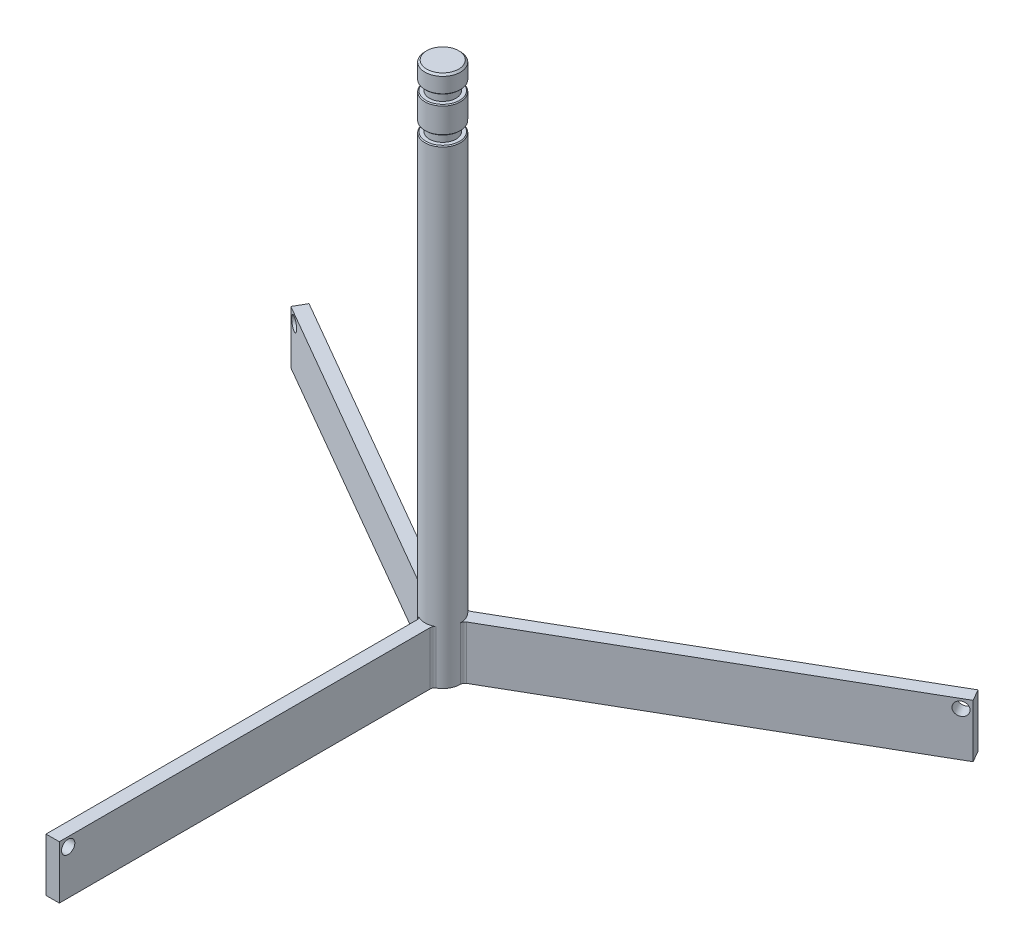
ISO-10303-21;
HEADER;
FILE_DESCRIPTION(('STEP AP214'),'2;1');
FILE_NAME('part.step','',(''),(''),'','','');
FILE_SCHEMA(('AUTOMOTIVE_DESIGN { 1 0 10303 214 1 1 1 1 }'));
ENDSEC;
DATA;
#1=APPLICATION_CONTEXT('core data for automotive mechanical design processes');
#2=APPLICATION_PROTOCOL_DEFINITION('international standard','automotive_design',2000,#1);
#3=PRODUCT_CONTEXT('',#1,'mechanical');
#4=PRODUCT('Part','Part','',(#3));
#5=PRODUCT_RELATED_PRODUCT_CATEGORY('part','',(#4));
#6=PRODUCT_DEFINITION_FORMATION('','',#4);
#7=PRODUCT_DEFINITION_CONTEXT('part definition',#1,'design');
#8=PRODUCT_DEFINITION('design','',#6,#7);
#9=PRODUCT_DEFINITION_SHAPE('','',#8);
#10=(LENGTH_UNIT() NAMED_UNIT(*) SI_UNIT(.MILLI.,.METRE.));
#11=(NAMED_UNIT(*) PLANE_ANGLE_UNIT() SI_UNIT($,.RADIAN.));
#12=(NAMED_UNIT(*) SI_UNIT($,.STERADIAN.) SOLID_ANGLE_UNIT());
#13=UNCERTAINTY_MEASURE_WITH_UNIT(LENGTH_MEASURE(1.E-05),#10,'distance_accuracy_value','');
#14=(GEOMETRIC_REPRESENTATION_CONTEXT(3) GLOBAL_UNCERTAINTY_ASSIGNED_CONTEXT((#13)) GLOBAL_UNIT_ASSIGNED_CONTEXT((#10,
#11,#12)) REPRESENTATION_CONTEXT('',''));
#15=CARTESIAN_POINT('',(0.,0.,0.));
#16=DIRECTION('',(0.,0.,1.));
#17=DIRECTION('',(1.,0.,0.));
#18=AXIS2_PLACEMENT_3D('',#15,#16,#17);
#19=CARTESIAN_POINT('',(0.,381.,0.));
#20=DIRECTION('',(0.,-1.,0.));
#21=DIRECTION('',(0.,0.,-1.));
#22=AXIS2_PLACEMENT_3D('',#19,#20,#21);
#23=CYLINDRICAL_SURFACE('',#22,12.7);
#24=CARTESIAN_POINT('',(0.,361.315,0.));
#25=DIRECTION('',(0.,-1.,0.));
#26=DIRECTION('',(0.,0.,-1.));
#27=AXIS2_PLACEMENT_3D('',#24,#25,#26);
#28=CIRCLE('',#27,12.7);
#29=CARTESIAN_POINT('',(0.,361.315,-12.7));
#30=VERTEX_POINT('',#29);
#31=EDGE_CURVE('E334',#30,#30,#28,.T.);
#32=ORIENTED_EDGE('',*,*,#31,.T.);
#33=EDGE_LOOP('',(#32));
#34=FACE_BOUND('',#33,.T.);
#35=CARTESIAN_POINT('',(0.,343.535,0.));
#36=DIRECTION('',(0.,1.,0.));
#37=DIRECTION('',(0.,0.,1.));
#38=AXIS2_PLACEMENT_3D('',#35,#36,#37);
#39=CIRCLE('',#38,12.7);
#40=CARTESIAN_POINT('',(0.,343.535,12.7));
#41=VERTEX_POINT('',#40);
#42=EDGE_CURVE('E316',#41,#41,#39,.T.);
#43=ORIENTED_EDGE('',*,*,#42,.T.);
#44=EDGE_LOOP('',(#43));
#45=FACE_BOUND('',#44,.T.);
#46=ADVANCED_FACE('F32',(#34,#45),#23,.T.);
#47=CARTESIAN_POINT('',(0.,335.915,0.));
#48=DIRECTION('',(0.,-1.,0.));
#49=DIRECTION('',(0.,0.,-1.));
#50=AXIS2_PLACEMENT_3D('',#47,#48,#49);
#51=CIRCLE('',#50,12.7);
#52=CARTESIAN_POINT('',(0.,335.915,-12.7));
#53=VERTEX_POINT('',#52);
#54=EDGE_CURVE('E322',#53,#53,#51,.T.);
#55=ORIENTED_EDGE('',*,*,#54,.T.);
#56=EDGE_LOOP('',(#55));
#57=FACE_BOUND('',#56,.T.);
#58=CARTESIAN_POINT('',(0.,0.,0.));
#59=DIRECTION('',(0.,1.,0.));
#60=DIRECTION('',(0.,0.,1.));
#61=AXIS2_PLACEMENT_3D('',#58,#59,#60);
#62=CIRCLE('',#61,12.7);
#63=CARTESIAN_POINT('',(6.35,0.,10.9985226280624));
#64=VERTEX_POINT('',#63);
#65=CARTESIAN_POINT('',(12.7,0.,1.94289029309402E-13));
#66=VERTEX_POINT('',#65);
#67=EDGE_CURVE('E251',#64,#66,#62,.T.);
#68=ORIENTED_EDGE('',*,*,#67,.T.);
#69=DIRECTION('',(0.,-1.,0.));
#70=VECTOR('',#69,1.);
#71=CARTESIAN_POINT('',(12.7,381.,1.94289029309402E-13));
#72=LINE('',#71,#70);
#73=CARTESIAN_POINT('',(12.7,38.1,1.94289029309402E-13));
#74=VERTEX_POINT('',#73);
#75=EDGE_CURVE('E304',#66,#74,#72,.F.);
#76=ORIENTED_EDGE('',*,*,#75,.T.);
#77=CARTESIAN_POINT('',(0.,38.1,0.));
#78=DIRECTION('',(0.,1.,0.));
#79=DIRECTION('',(0.,0.,1.));
#80=AXIS2_PLACEMENT_3D('',#77,#78,#79);
#81=CIRCLE('',#80,12.7);
#82=CARTESIAN_POINT('',(6.3500000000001,38.1,-10.9985226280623));
#83=VERTEX_POINT('',#82);
#84=EDGE_CURVE('E279',#74,#83,#81,.T.);
#85=ORIENTED_EDGE('',*,*,#84,.T.);
#86=DIRECTION('',(0.,-1.,0.));
#87=VECTOR('',#86,1.);
#88=CARTESIAN_POINT('',(6.3500000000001,381.,-10.9985226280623));
#89=LINE('',#88,#87);
#90=CARTESIAN_POINT('',(6.3500000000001,0.,-10.9985226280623));
#91=VERTEX_POINT('',#90);
#92=EDGE_CURVE('E302',#83,#91,#89,.T.);
#93=ORIENTED_EDGE('',*,*,#92,.T.);
#94=CARTESIAN_POINT('',(-6.34999999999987,0.,-10.9985226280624));
#95=VERTEX_POINT('',#94);
#96=EDGE_CURVE('E255',#91,#95,#62,.T.);
#97=ORIENTED_EDGE('',*,*,#96,.T.);
#98=DIRECTION('',(0.,-1.,0.));
#99=VECTOR('',#98,1.);
#100=CARTESIAN_POINT('',(-6.34999999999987,381.,-10.9985226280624));
#101=LINE('',#100,#99);
#102=CARTESIAN_POINT('',(-6.34999999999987,38.1,-10.9985226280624));
#103=VERTEX_POINT('',#102);
#104=EDGE_CURVE('E284',#95,#103,#101,.F.);
#105=ORIENTED_EDGE('',*,*,#104,.T.);
#106=CARTESIAN_POINT('',(-12.7,38.1,0.));
#107=VERTEX_POINT('',#106);
#108=EDGE_CURVE('E280',#103,#107,#81,.T.);
#109=ORIENTED_EDGE('',*,*,#108,.T.);
#110=DIRECTION('',(0.,-1.,0.));
#111=VECTOR('',#110,1.);
#112=CARTESIAN_POINT('',(-12.7,381.,0.));
#113=LINE('',#112,#111);
#114=CARTESIAN_POINT('',(-12.7,0.,0.));
#115=VERTEX_POINT('',#114);
#116=EDGE_CURVE('E282',#107,#115,#113,.T.);
#117=ORIENTED_EDGE('',*,*,#116,.T.);
#118=CARTESIAN_POINT('',(-6.35000000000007,0.,10.9985226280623));
#119=VERTEX_POINT('',#118);
#120=EDGE_CURVE('E242',#115,#119,#62,.T.);
#121=ORIENTED_EDGE('',*,*,#120,.T.);
#122=DIRECTION('',(0.,-1.,0.));
#123=VECTOR('',#122,1.);
#124=CARTESIAN_POINT('',(-6.35000000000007,381.,10.9985226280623));
#125=LINE('',#124,#123);
#126=CARTESIAN_POINT('',(-6.35000000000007,38.1,10.9985226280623));
#127=VERTEX_POINT('',#126);
#128=EDGE_CURVE('E261',#119,#127,#125,.F.);
#129=ORIENTED_EDGE('',*,*,#128,.T.);
#130=CARTESIAN_POINT('',(0.,38.1,0.));
#131=DIRECTION('',(0.,1.,0.));
#132=DIRECTION('',(0.,0.,1.));
#133=AXIS2_PLACEMENT_3D('',#130,#131,#132);
#134=CIRCLE('',#133,12.7);
#135=CARTESIAN_POINT('',(6.35,38.1,10.9985226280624));
#136=VERTEX_POINT('',#135);
#137=EDGE_CURVE('E254',#127,#136,#134,.T.);
#138=ORIENTED_EDGE('',*,*,#137,.T.);
#139=DIRECTION('',(0.,-1.,0.));
#140=VECTOR('',#139,1.);
#141=CARTESIAN_POINT('',(6.35,381.,10.9985226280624));
#142=LINE('',#141,#140);
#143=EDGE_CURVE('E257',#136,#64,#142,.T.);
#144=ORIENTED_EDGE('',*,*,#143,.T.);
#145=EDGE_LOOP('',(#68,#76,#85,#93,#97,#105,#109,#117,#121,#129,#138,#144));
#146=FACE_BOUND('',#145,.T.);
#147=ADVANCED_FACE('F354',(#57,#146),#23,.T.);
#148=CARTESIAN_POINT('',(0.,0.,0.));
#149=DIRECTION('',(0.,1.,0.));
#150=DIRECTION('',(0.,0.,1.));
#151=AXIS2_PLACEMENT_3D('',#148,#149,#150);
#152=PLANE('',#151);
#153=ORIENTED_EDGE('',*,*,#120,.F.);
#154=CARTESIAN_POINT('',(-15.875,0.,0.));
#155=DIRECTION('',(0.,1.,0.));
#156=DIRECTION('',(0.,0.,1.));
#157=AXIS2_PLACEMENT_3D('',#154,#155,#156);
#158=CIRCLE('',#157,3.175);
#159=CARTESIAN_POINT('',(-14.2875,0.,-2.74963065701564));
#160=VERTEX_POINT('',#159);
#161=EDGE_CURVE('E300',#115,#160,#158,.T.);
#162=ORIENTED_EDGE('',*,*,#161,.T.);
#163=DIRECTION('',(0.866025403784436,0.,0.500000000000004));
#164=VECTOR('',#163,1.);
#165=CARTESIAN_POINT('',(-244.348747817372,0.,-135.575554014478));
#166=LINE('',#165,#164);
#167=CARTESIAN_POINT('',(-244.348747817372,0.,-135.575554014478));
#168=VERTEX_POINT('',#167);
#169=EDGE_CURVE('E216',#168,#160,#166,.T.);
#170=ORIENTED_EDGE('',*,*,#169,.F.);
#171=DIRECTION('',(0.500000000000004,0.,-0.866025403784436));
#172=VECTOR('',#171,1.);
#173=CARTESIAN_POINT('',(-244.348747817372,0.,-135.575554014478));
#174=LINE('',#173,#172);
#175=CARTESIAN_POINT('',(-239.586247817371,0.,-143.824445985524));
#176=VERTEX_POINT('',#175);
#177=EDGE_CURVE('E208',#168,#176,#174,.T.);
#178=ORIENTED_EDGE('',*,*,#177,.T.);
#179=DIRECTION('',(0.866025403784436,0.,0.500000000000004));
#180=VECTOR('',#179,1.);
#181=CARTESIAN_POINT('',(-239.586247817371,0.,-143.824445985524));
#182=LINE('',#181,#180);
#183=CARTESIAN_POINT('',(-9.52499999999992,0.,-10.9985226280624));
#184=VERTEX_POINT('',#183);
#185=EDGE_CURVE('E212',#176,#184,#182,.T.);
#186=ORIENTED_EDGE('',*,*,#185,.T.);
#187=CARTESIAN_POINT('',(-7.93749999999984,0.,-13.7481532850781));
#188=DIRECTION('',(0.,1.,0.));
#189=DIRECTION('',(0.,0.,1.));
#190=AXIS2_PLACEMENT_3D('',#187,#188,#189);
#191=CIRCLE('',#190,3.175);
#192=EDGE_CURVE('E294',#184,#95,#191,.T.);
#193=ORIENTED_EDGE('',*,*,#192,.T.);
#194=ORIENTED_EDGE('',*,*,#96,.F.);
#195=CARTESIAN_POINT('',(7.93750000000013,0.,-13.7481532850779));
#196=DIRECTION('',(0.,1.,0.));
#197=DIRECTION('',(0.,0.,1.));
#198=AXIS2_PLACEMENT_3D('',#195,#196,#197);
#199=CIRCLE('',#198,3.175);
#200=CARTESIAN_POINT('',(9.52500000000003,0.,-10.9985226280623));
#201=VERTEX_POINT('',#200);
#202=EDGE_CURVE('E55',#91,#201,#199,.T.);
#203=ORIENTED_EDGE('',*,*,#202,.T.);
#204=DIRECTION('',(-0.866025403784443,0.,0.499999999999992));
#205=VECTOR('',#204,1.);
#206=CARTESIAN_POINT('',(239.586247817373,0.,-143.824445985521));
#207=LINE('',#206,#205);
#208=CARTESIAN_POINT('',(239.586247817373,0.,-143.824445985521));
#209=VERTEX_POINT('',#208);
#210=EDGE_CURVE('E198',#209,#201,#207,.T.);
#211=ORIENTED_EDGE('',*,*,#210,.F.);
#212=DIRECTION('',(0.499999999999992,0.,0.866025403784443));
#213=VECTOR('',#212,1.);
#214=CARTESIAN_POINT('',(239.586247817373,0.,-143.824445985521));
#215=LINE('',#214,#213);
#216=CARTESIAN_POINT('',(244.348747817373,0.,-135.575554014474));
#217=VERTEX_POINT('',#216);
#218=EDGE_CURVE('E171',#209,#217,#215,.T.);
#219=ORIENTED_EDGE('',*,*,#218,.T.);
#220=DIRECTION('',(-0.866025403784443,0.,0.499999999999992));
#221=VECTOR('',#220,1.);
#222=CARTESIAN_POINT('',(244.348747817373,0.,-135.575554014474));
#223=LINE('',#222,#221);
#224=CARTESIAN_POINT('',(14.2874999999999,0.,-2.74963065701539));
#225=VERTEX_POINT('',#224);
#226=EDGE_CURVE('E185',#217,#225,#223,.T.);
#227=ORIENTED_EDGE('',*,*,#226,.T.);
#228=CARTESIAN_POINT('',(15.875,0.,2.42861286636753E-13));
#229=DIRECTION('',(0.,1.,0.));
#230=DIRECTION('',(0.,0.,1.));
#231=AXIS2_PLACEMENT_3D('',#228,#229,#230);
#232=CIRCLE('',#231,3.175);
#233=EDGE_CURVE('E312',#225,#66,#232,.T.);
#234=ORIENTED_EDGE('',*,*,#233,.T.);
#235=ORIENTED_EDGE('',*,*,#67,.F.);
#236=CARTESIAN_POINT('',(7.9375,0.,13.748153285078));
#237=DIRECTION('',(0.,1.,0.));
#238=DIRECTION('',(0.,0.,1.));
#239=AXIS2_PLACEMENT_3D('',#236,#237,#238);
#240=CIRCLE('',#239,3.175);
#241=CARTESIAN_POINT('',(4.7625,0.,13.7481532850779));
#242=VERTEX_POINT('',#241);
#243=EDGE_CURVE('E277',#64,#242,#240,.T.);
#244=ORIENTED_EDGE('',*,*,#243,.T.);
#245=DIRECTION('',(0.,0.,-1.));
#246=VECTOR('',#245,1.);
#247=CARTESIAN_POINT('',(4.7625,0.,279.4));
#248=LINE('',#247,#246);
#249=CARTESIAN_POINT('',(4.7625,0.,279.4));
#250=VERTEX_POINT('',#249);
#251=EDGE_CURVE('E243',#250,#242,#248,.T.);
#252=ORIENTED_EDGE('',*,*,#251,.F.);
#253=DIRECTION('',(-1.,0.,0.));
#254=VECTOR('',#253,1.);
#255=CARTESIAN_POINT('',(4.7625,0.,279.4));
#256=LINE('',#255,#254);
#257=CARTESIAN_POINT('',(-4.7625,0.,279.4));
#258=VERTEX_POINT('',#257);
#259=EDGE_CURVE('E235',#250,#258,#256,.T.);
#260=ORIENTED_EDGE('',*,*,#259,.T.);
#261=DIRECTION('',(0.,0.,-1.));
#262=VECTOR('',#261,1.);
#263=CARTESIAN_POINT('',(-4.7625,0.,279.4));
#264=LINE('',#263,#262);
#265=CARTESIAN_POINT('',(-4.7625,0.,13.7481532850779));
#266=VERTEX_POINT('',#265);
#267=EDGE_CURVE('E239',#258,#266,#264,.T.);
#268=ORIENTED_EDGE('',*,*,#267,.T.);
#269=CARTESIAN_POINT('',(-7.93750000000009,0.,13.7481532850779));
#270=DIRECTION('',(0.,1.,0.));
#271=DIRECTION('',(0.,0.,1.));
#272=AXIS2_PLACEMENT_3D('',#269,#270,#271);
#273=CIRCLE('',#272,3.175);
#274=EDGE_CURVE('E271',#266,#119,#273,.T.);
#275=ORIENTED_EDGE('',*,*,#274,.T.);
#276=EDGE_LOOP('',(#153,#162,#170,#178,#186,#193,#194,#203,#211,#219,#227,#234,#235,#244,#252,
#260,#268,#275));
#277=FACE_BOUND('',#276,.T.);
#278=ADVANCED_FACE('F361',(#277),#152,.F.);
#279=CARTESIAN_POINT('',(-4.76250000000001,38.1,279.4));
#280=DIRECTION('',(0.,1.,0.));
#281=DIRECTION('',(0.,0.,1.));
#282=AXIS2_PLACEMENT_3D('',#279,#280,#281);
#283=PLANE('',#282);
#284=ORIENTED_EDGE('',*,*,#137,.F.);
#285=CARTESIAN_POINT('',(-7.93750000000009,38.1,13.7481532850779));
#286=DIRECTION('',(0.,1.,0.));
#287=DIRECTION('',(0.,0.,1.));
#288=AXIS2_PLACEMENT_3D('',#285,#286,#287);
#289=CIRCLE('',#288,3.175);
#290=CARTESIAN_POINT('',(-4.76250000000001,38.1,13.7481532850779));
#291=VERTEX_POINT('',#290);
#292=EDGE_CURVE('E269',#127,#291,#289,.F.);
#293=ORIENTED_EDGE('',*,*,#292,.T.);
#294=DIRECTION('',(0.,0.,-1.));
#295=VECTOR('',#294,1.);
#296=CARTESIAN_POINT('',(-4.76250000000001,38.1,279.4));
#297=LINE('',#296,#295);
#298=CARTESIAN_POINT('',(-4.76250000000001,38.1,279.4));
#299=VERTEX_POINT('',#298);
#300=EDGE_CURVE('E238',#299,#291,#297,.T.);
#301=ORIENTED_EDGE('',*,*,#300,.F.);
#302=DIRECTION('',(1.,0.,0.));
#303=VECTOR('',#302,1.);
#304=CARTESIAN_POINT('',(-4.76250000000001,38.1,279.4));
#305=LINE('',#304,#303);
#306=CARTESIAN_POINT('',(4.7625,38.1,279.4));
#307=VERTEX_POINT('',#306);
#308=EDGE_CURVE('E230',#299,#307,#305,.T.);
#309=ORIENTED_EDGE('',*,*,#308,.T.);
#310=DIRECTION('',(0.,0.,-1.));
#311=VECTOR('',#310,1.);
#312=CARTESIAN_POINT('',(4.7625,38.1,279.4));
#313=LINE('',#312,#311);
#314=CARTESIAN_POINT('',(4.7625,38.1,13.7481532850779));
#315=VERTEX_POINT('',#314);
#316=EDGE_CURVE('E246',#307,#315,#313,.T.);
#317=ORIENTED_EDGE('',*,*,#316,.T.);
#318=CARTESIAN_POINT('',(7.9375,38.1,13.748153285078));
#319=DIRECTION('',(0.,1.,0.));
#320=DIRECTION('',(0.,0.,1.));
#321=AXIS2_PLACEMENT_3D('',#318,#319,#320);
#322=CIRCLE('',#321,3.175);
#323=EDGE_CURVE('E274',#315,#136,#322,.F.);
#324=ORIENTED_EDGE('',*,*,#323,.T.);
#325=EDGE_LOOP('',(#284,#293,#301,#309,#317,#324));
#326=FACE_BOUND('',#325,.T.);
#327=ADVANCED_FACE('F389',(#326),#283,.T.);
#328=CARTESIAN_POINT('',(-4.7625,0.,279.4));
#329=DIRECTION('',(-1.,0.,0.));
#330=DIRECTION('',(0.,-1.,0.));
#331=AXIS2_PLACEMENT_3D('',#328,#329,#330);
#332=PLANE('',#331);
#333=CARTESIAN_POINT('',(-4.76250000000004,31.75,273.05));
#334=DIRECTION('',(-1.,0.,0.));
#335=DIRECTION('',(0.,0.,1.));
#336=AXIS2_PLACEMENT_3D('',#333,#334,#335);
#337=CIRCLE('',#336,4.76250000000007);
#338=CARTESIAN_POINT('',(-4.76250000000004,31.75,277.8125));
#339=VERTEX_POINT('',#338);
#340=EDGE_CURVE('E215',#339,#339,#337,.T.);
#341=ORIENTED_EDGE('',*,*,#340,.F.);
#342=EDGE_LOOP('',(#341));
#343=FACE_BOUND('',#342,.T.);
#344=ORIENTED_EDGE('',*,*,#300,.T.);
#345=DIRECTION('',(0.,-1.,0.));
#346=VECTOR('',#345,1.);
#347=CARTESIAN_POINT('',(-4.7625,0.,13.7481532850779));
#348=LINE('',#347,#346);
#349=EDGE_CURVE('E264',#291,#266,#348,.T.);
#350=ORIENTED_EDGE('',*,*,#349,.T.);
#351=ORIENTED_EDGE('',*,*,#267,.F.);
#352=DIRECTION('',(0.,1.,0.));
#353=VECTOR('',#352,1.);
#354=CARTESIAN_POINT('',(-4.7625,0.,279.4));
#355=LINE('',#354,#353);
#356=EDGE_CURVE('E227',#258,#299,#355,.T.);
#357=ORIENTED_EDGE('',*,*,#356,.T.);
#358=EDGE_LOOP('',(#344,#350,#351,#357));
#359=FACE_BOUND('',#358,.T.);
#360=ADVANCED_FACE('F386',(#343,#359),#332,.T.);
#361=CARTESIAN_POINT('',(4.7625,0.,279.4));
#362=DIRECTION('',(-1.,0.,0.));
#363=DIRECTION('',(0.,0.,1.));
#364=AXIS2_PLACEMENT_3D('',#361,#362,#363);
#365=PLANE('',#364);
#366=CARTESIAN_POINT('',(4.7625,31.75,273.05));
#367=DIRECTION('',(-1.,0.,0.));
#368=DIRECTION('',(0.,0.,1.));
#369=AXIS2_PLACEMENT_3D('',#366,#367,#368);
#370=CIRCLE('',#369,4.76250000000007);
#371=CARTESIAN_POINT('',(4.7625,31.75,277.8125));
#372=VERTEX_POINT('',#371);
#373=EDGE_CURVE('E226',#372,#372,#370,.T.);
#374=ORIENTED_EDGE('',*,*,#373,.T.);
#375=EDGE_LOOP('',(#374));
#376=FACE_BOUND('',#375,.T.);
#377=ORIENTED_EDGE('',*,*,#251,.T.);
#378=DIRECTION('',(0.,1.,0.));
#379=VECTOR('',#378,1.);
#380=CARTESIAN_POINT('',(4.7625,38.1,13.748153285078));
#381=LINE('',#380,#379);
#382=EDGE_CURVE('E266',#242,#315,#381,.T.);
#383=ORIENTED_EDGE('',*,*,#382,.T.);
#384=ORIENTED_EDGE('',*,*,#316,.F.);
#385=DIRECTION('',(0.,1.,0.));
#386=VECTOR('',#385,1.);
#387=CARTESIAN_POINT('',(4.7625,0.,279.4));
#388=LINE('',#387,#386);
#389=EDGE_CURVE('E233',#250,#307,#388,.T.);
#390=ORIENTED_EDGE('',*,*,#389,.F.);
#391=EDGE_LOOP('',(#377,#383,#384,#390));
#392=FACE_BOUND('',#391,.T.);
#393=ADVANCED_FACE('F437',(#376,#392),#365,.F.);
#394=CARTESIAN_POINT('',(-4.76250000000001,38.1,279.4));
#395=DIRECTION('',(0.,0.,-1.));
#396=DIRECTION('',(-1.,0.,0.));
#397=AXIS2_PLACEMENT_3D('',#394,#395,#396);
#398=PLANE('',#397);
#399=ORIENTED_EDGE('',*,*,#356,.F.);
#400=ORIENTED_EDGE('',*,*,#259,.F.);
#401=ORIENTED_EDGE('',*,*,#389,.T.);
#402=ORIENTED_EDGE('',*,*,#308,.F.);
#403=EDGE_LOOP('',(#399,#400,#401,#402));
#404=FACE_BOUND('',#403,.T.);
#405=ADVANCED_FACE('F442',(#404),#398,.F.);
#406=CARTESIAN_POINT('',(12.7,31.75,273.05));
#407=DIRECTION('',(-1.,0.,0.));
#408=DIRECTION('',(0.,0.,1.));
#409=AXIS2_PLACEMENT_3D('',#406,#407,#408);
#410=CYLINDRICAL_SURFACE('',#409,4.76250000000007);
#411=ORIENTED_EDGE('',*,*,#340,.T.);
#412=EDGE_LOOP('',(#411));
#413=FACE_BOUND('',#412,.T.);
#414=ORIENTED_EDGE('',*,*,#373,.F.);
#415=EDGE_LOOP('',(#414));
#416=FACE_BOUND('',#415,.T.);
#417=ADVANCED_FACE('F450',(#413,#416),#410,.F.);
#418=CARTESIAN_POINT('',(-7.93750000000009,381.,13.7481532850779));
#419=DIRECTION('',(0.,-1.,0.));
#420=DIRECTION('',(0.,0.,-1.));
#421=AXIS2_PLACEMENT_3D('',#418,#419,#420);
#422=CYLINDRICAL_SURFACE('',#421,3.175);
#423=ORIENTED_EDGE('',*,*,#274,.F.);
#424=ORIENTED_EDGE('',*,*,#349,.F.);
#425=ORIENTED_EDGE('',*,*,#292,.F.);
#426=ORIENTED_EDGE('',*,*,#128,.F.);
#427=EDGE_LOOP('',(#423,#424,#425,#426));
#428=FACE_BOUND('',#427,.T.);
#429=ADVANCED_FACE('F447',(#428),#422,.F.);
#430=CARTESIAN_POINT('',(7.9375,381.,13.748153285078));
#431=DIRECTION('',(0.,-1.,0.));
#432=DIRECTION('',(0.,0.,-1.));
#433=AXIS2_PLACEMENT_3D('',#430,#431,#432);
#434=CYLINDRICAL_SURFACE('',#433,3.175);
#435=ORIENTED_EDGE('',*,*,#243,.F.);
#436=ORIENTED_EDGE('',*,*,#143,.F.);
#437=ORIENTED_EDGE('',*,*,#323,.F.);
#438=ORIENTED_EDGE('',*,*,#382,.F.);
#439=EDGE_LOOP('',(#435,#436,#437,#438));
#440=FACE_BOUND('',#439,.T.);
#441=ADVANCED_FACE('F434',(#440),#434,.F.);
#442=CARTESIAN_POINT('',(244.348747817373,38.1,-135.575554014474));
#443=DIRECTION('',(-0.866025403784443,0.,0.499999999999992));
#444=DIRECTION('',(0.499999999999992,0.,0.866025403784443));
#445=AXIS2_PLACEMENT_3D('',#442,#443,#444);
#446=PLANE('',#445);
#447=DIRECTION('',(0.,1.,0.));
#448=VECTOR('',#447,1.);
#449=CARTESIAN_POINT('',(244.348747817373,0.,-135.575554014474));
#450=LINE('',#449,#448);
#451=CARTESIAN_POINT('',(244.348747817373,38.1,-135.575554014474));
#452=VERTEX_POINT('',#451);
#453=EDGE_CURVE('E177',#217,#452,#450,.T.);
#454=ORIENTED_EDGE('',*,*,#453,.F.);
#455=ORIENTED_EDGE('',*,*,#218,.F.);
#456=DIRECTION('',(0.,1.,0.));
#457=VECTOR('',#456,1.);
#458=CARTESIAN_POINT('',(239.586247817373,0.,-143.824445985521));
#459=LINE('',#458,#457);
#460=CARTESIAN_POINT('',(239.586247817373,38.1,-143.824445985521));
#461=VERTEX_POINT('',#460);
#462=EDGE_CURVE('E180',#209,#461,#459,.T.);
#463=ORIENTED_EDGE('',*,*,#462,.T.);
#464=DIRECTION('',(-0.499999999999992,0.,-0.866025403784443));
#465=VECTOR('',#464,1.);
#466=CARTESIAN_POINT('',(244.348747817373,38.1,-135.575554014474));
#467=LINE('',#466,#465);
#468=EDGE_CURVE('E164',#452,#461,#467,.T.);
#469=ORIENTED_EDGE('',*,*,#468,.F.);
#470=EDGE_LOOP('',(#454,#455,#463,#469));
#471=FACE_BOUND('',#470,.T.);
#472=ADVANCED_FACE('F175',(#471),#446,.F.);
#473=CARTESIAN_POINT('',(239.586247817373,0.,-143.824445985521));
#474=DIRECTION('',(0.499999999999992,0.,0.866025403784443));
#475=DIRECTION('',(0.866025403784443,0.,-0.499999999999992));
#476=AXIS2_PLACEMENT_3D('',#473,#474,#475);
#477=PLANE('',#476);
#478=CARTESIAN_POINT('',(234.086986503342,31.75,-140.649445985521));
#479=DIRECTION('',(0.499999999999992,0.,0.866025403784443));
#480=DIRECTION('',(0.866025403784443,0.,-0.499999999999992));
#481=AXIS2_PLACEMENT_3D('',#478,#479,#480);
#482=CIRCLE('',#481,4.76250000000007);
#483=CARTESIAN_POINT('',(238.211432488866,31.75,-143.030695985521));
#484=VERTEX_POINT('',#483);
#485=EDGE_CURVE('E507',#484,#484,#482,.T.);
#486=ORIENTED_EDGE('',*,*,#485,.T.);
#487=EDGE_LOOP('',(#486));
#488=FACE_BOUND('',#487,.T.);
#489=ORIENTED_EDGE('',*,*,#210,.T.);
#490=DIRECTION('',(0.,1.,0.));
#491=VECTOR('',#490,1.);
#492=CARTESIAN_POINT('',(9.5250000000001,38.1,-10.9985226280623));
#493=LINE('',#492,#491);
#494=CARTESIAN_POINT('',(9.52500000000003,38.1,-10.9985226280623));
#495=VERTEX_POINT('',#494);
#496=EDGE_CURVE('E309',#201,#495,#493,.T.);
#497=ORIENTED_EDGE('',*,*,#496,.T.);
#498=DIRECTION('',(-0.866025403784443,0.,0.499999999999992));
#499=VECTOR('',#498,1.);
#500=CARTESIAN_POINT('',(239.586247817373,38.1,-143.824445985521));
#501=LINE('',#500,#499);
#502=EDGE_CURVE('E170',#461,#495,#501,.T.);
#503=ORIENTED_EDGE('',*,*,#502,.F.);
#504=ORIENTED_EDGE('',*,*,#462,.F.);
#505=EDGE_LOOP('',(#489,#497,#503,#504));
#506=FACE_BOUND('',#505,.T.);
#507=ADVANCED_FACE('F424',(#488,#506),#477,.F.);
#508=CARTESIAN_POINT('',(244.348747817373,0.,-135.575554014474));
#509=DIRECTION('',(0.499999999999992,0.,0.866025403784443));
#510=DIRECTION('',(0.866025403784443,0.,-0.499999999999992));
#511=AXIS2_PLACEMENT_3D('',#508,#509,#510);
#512=PLANE('',#511);
#513=CARTESIAN_POINT('',(238.849486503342,31.75,-132.400554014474));
#514=DIRECTION('',(0.499999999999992,0.,0.866025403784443));
#515=DIRECTION('',(0.866025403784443,0.,-0.499999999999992));
#516=AXIS2_PLACEMENT_3D('',#513,#514,#515);
#517=CIRCLE('',#516,4.76250000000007);
#518=CARTESIAN_POINT('',(242.973932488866,31.75,-134.781804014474));
#519=VERTEX_POINT('',#518);
#520=EDGE_CURVE('E499',#519,#519,#517,.T.);
#521=ORIENTED_EDGE('',*,*,#520,.F.);
#522=EDGE_LOOP('',(#521));
#523=FACE_BOUND('',#522,.T.);
#524=DIRECTION('',(-0.866025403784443,0.,0.499999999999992));
#525=VECTOR('',#524,1.);
#526=CARTESIAN_POINT('',(244.348747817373,38.1,-135.575554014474));
#527=LINE('',#526,#525);
#528=CARTESIAN_POINT('',(14.2874999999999,38.1,-2.74963065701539));
#529=VERTEX_POINT('',#528);
#530=EDGE_CURVE('E160',#452,#529,#527,.T.);
#531=ORIENTED_EDGE('',*,*,#530,.T.);
#532=DIRECTION('',(0.,-1.,0.));
#533=VECTOR('',#532,1.);
#534=CARTESIAN_POINT('',(14.2875,0.,-2.74963065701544));
#535=LINE('',#534,#533);
#536=EDGE_CURVE('E307',#529,#225,#535,.T.);
#537=ORIENTED_EDGE('',*,*,#536,.T.);
#538=ORIENTED_EDGE('',*,*,#226,.F.);
#539=ORIENTED_EDGE('',*,*,#453,.T.);
#540=EDGE_LOOP('',(#531,#537,#538,#539));
#541=FACE_BOUND('',#540,.T.);
#542=ADVANCED_FACE('F183',(#523,#541),#512,.T.);
#543=CARTESIAN_POINT('',(-239.586247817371,38.1,-143.824445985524));
#544=DIRECTION('',(0.,1.,0.));
#545=DIRECTION('',(0.,0.,1.));
#546=AXIS2_PLACEMENT_3D('',#543,#544,#545);
#547=PLANE('',#546);
#548=ORIENTED_EDGE('',*,*,#84,.F.);
#549=CARTESIAN_POINT('',(15.875,38.1,2.42861286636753E-13));
#550=DIRECTION('',(0.,1.,0.));
#551=DIRECTION('',(0.,0.,1.));
#552=AXIS2_PLACEMENT_3D('',#549,#550,#551);
#553=CIRCLE('',#552,3.175);
#554=EDGE_CURVE('E166',#74,#529,#553,.F.);
#555=ORIENTED_EDGE('',*,*,#554,.T.);
#556=ORIENTED_EDGE('',*,*,#530,.F.);
#557=ORIENTED_EDGE('',*,*,#468,.T.);
#558=ORIENTED_EDGE('',*,*,#502,.T.);
#559=CARTESIAN_POINT('',(7.93750000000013,38.1,-13.7481532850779));
#560=DIRECTION('',(0.,1.,0.));
#561=DIRECTION('',(0.,0.,1.));
#562=AXIS2_PLACEMENT_3D('',#559,#560,#561);
#563=CIRCLE('',#562,3.175);
#564=EDGE_CURVE('E47',#495,#83,#563,.F.);
#565=ORIENTED_EDGE('',*,*,#564,.T.);
#566=EDGE_LOOP('',(#548,#555,#556,#557,#558,#565));
#567=FACE_BOUND('',#566,.T.);
#568=ADVANCED_FACE('F162',(#567),#547,.T.);
#569=ORIENTED_EDGE('',*,*,#108,.F.);
#570=CARTESIAN_POINT('',(-7.93749999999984,38.1,-13.7481532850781));
#571=DIRECTION('',(0.,1.,0.));
#572=DIRECTION('',(0.,0.,1.));
#573=AXIS2_PLACEMENT_3D('',#570,#571,#572);
#574=CIRCLE('',#573,3.175);
#575=CARTESIAN_POINT('',(-9.52499999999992,38.1,-10.9985226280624));
#576=VERTEX_POINT('',#575);
#577=EDGE_CURVE('E292',#103,#576,#574,.F.);
#578=ORIENTED_EDGE('',*,*,#577,.T.);
#579=DIRECTION('',(0.866025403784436,0.,0.500000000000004));
#580=VECTOR('',#579,1.);
#581=CARTESIAN_POINT('',(-239.586247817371,38.1,-143.824445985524));
#582=LINE('',#581,#580);
#583=CARTESIAN_POINT('',(-239.586247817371,38.1,-143.824445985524));
#584=VERTEX_POINT('',#583);
#585=EDGE_CURVE('E211',#584,#576,#582,.T.);
#586=ORIENTED_EDGE('',*,*,#585,.F.);
#587=DIRECTION('',(-0.500000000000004,0.,0.866025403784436));
#588=VECTOR('',#587,1.);
#589=CARTESIAN_POINT('',(-239.586247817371,38.1,-143.824445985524));
#590=LINE('',#589,#588);
#591=CARTESIAN_POINT('',(-244.348747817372,38.1,-135.575554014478));
#592=VERTEX_POINT('',#591);
#593=EDGE_CURVE('E203',#584,#592,#590,.T.);
#594=ORIENTED_EDGE('',*,*,#593,.T.);
#595=DIRECTION('',(0.866025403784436,0.,0.500000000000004));
#596=VECTOR('',#595,1.);
#597=CARTESIAN_POINT('',(-244.348747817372,38.1,-135.575554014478));
#598=LINE('',#597,#596);
#599=CARTESIAN_POINT('',(-14.2875,38.1,-2.74963065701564));
#600=VERTEX_POINT('',#599);
#601=EDGE_CURVE('E219',#592,#600,#598,.T.);
#602=ORIENTED_EDGE('',*,*,#601,.T.);
#603=CARTESIAN_POINT('',(-15.875,38.1,0.));
#604=DIRECTION('',(0.,1.,0.));
#605=DIRECTION('',(0.,0.,1.));
#606=AXIS2_PLACEMENT_3D('',#603,#604,#605);
#607=CIRCLE('',#606,3.175);
#608=EDGE_CURVE('E297',#600,#107,#607,.F.);
#609=ORIENTED_EDGE('',*,*,#608,.T.);
#610=EDGE_LOOP('',(#569,#578,#586,#594,#602,#609));
#611=FACE_BOUND('',#610,.T.);
#612=ADVANCED_FACE('F408',(#611),#547,.T.);
#613=CARTESIAN_POINT('',(-239.586247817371,0.,-143.824445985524));
#614=DIRECTION('',(0.500000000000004,0.,-0.866025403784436));
#615=DIRECTION('',(-0.866025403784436,0.,-0.500000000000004));
#616=AXIS2_PLACEMENT_3D('',#613,#614,#615);
#617=PLANE('',#616);
#618=CARTESIAN_POINT('',(-234.08698650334,31.75,-140.649445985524));
#619=DIRECTION('',(0.500000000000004,0.,-0.866025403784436));
#620=DIRECTION('',(-0.866025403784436,0.,-0.500000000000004));
#621=AXIS2_PLACEMENT_3D('',#618,#619,#620);
#622=CIRCLE('',#621,4.76250000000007);
#623=CARTESIAN_POINT('',(-238.211432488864,31.75,-143.030695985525));
#624=VERTEX_POINT('',#623);
#625=EDGE_CURVE('E189',#624,#624,#622,.T.);
#626=ORIENTED_EDGE('',*,*,#625,.F.);
#627=EDGE_LOOP('',(#626));
#628=FACE_BOUND('',#627,.T.);
#629=ORIENTED_EDGE('',*,*,#585,.T.);
#630=DIRECTION('',(0.,-1.,0.));
#631=VECTOR('',#630,1.);
#632=CARTESIAN_POINT('',(-9.52499999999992,0.,-10.9985226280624));
#633=LINE('',#632,#631);
#634=EDGE_CURVE('E287',#576,#184,#633,.T.);
#635=ORIENTED_EDGE('',*,*,#634,.T.);
#636=ORIENTED_EDGE('',*,*,#185,.F.);
#637=DIRECTION('',(0.,1.,0.));
#638=VECTOR('',#637,1.);
#639=CARTESIAN_POINT('',(-239.586247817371,0.,-143.824445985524));
#640=LINE('',#639,#638);
#641=EDGE_CURVE('E197',#176,#584,#640,.T.);
#642=ORIENTED_EDGE('',*,*,#641,.T.);
#643=EDGE_LOOP('',(#629,#635,#636,#642));
#644=FACE_BOUND('',#643,.T.);
#645=ADVANCED_FACE('F415',(#628,#644),#617,.T.);
#646=CARTESIAN_POINT('',(-244.348747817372,0.,-135.575554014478));
#647=DIRECTION('',(0.500000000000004,0.,-0.866025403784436));
#648=DIRECTION('',(-0.866025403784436,0.,-0.500000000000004));
#649=AXIS2_PLACEMENT_3D('',#646,#647,#648);
#650=PLANE('',#649);
#651=CARTESIAN_POINT('',(-238.84948650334,31.75,-132.400554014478));
#652=DIRECTION('',(0.500000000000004,0.,-0.866025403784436));
#653=DIRECTION('',(-0.866025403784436,0.,-0.500000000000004));
#654=AXIS2_PLACEMENT_3D('',#651,#652,#653);
#655=CIRCLE('',#654,4.76250000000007);
#656=CARTESIAN_POINT('',(-242.973932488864,31.75,-134.781804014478));
#657=VERTEX_POINT('',#656);
#658=EDGE_CURVE('E186',#657,#657,#655,.T.);
#659=ORIENTED_EDGE('',*,*,#658,.T.);
#660=EDGE_LOOP('',(#659));
#661=FACE_BOUND('',#660,.T.);
#662=ORIENTED_EDGE('',*,*,#169,.T.);
#663=DIRECTION('',(0.,1.,0.));
#664=VECTOR('',#663,1.);
#665=CARTESIAN_POINT('',(-14.2875,38.1,-2.74963065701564));
#666=LINE('',#665,#664);
#667=EDGE_CURVE('E289',#160,#600,#666,.T.);
#668=ORIENTED_EDGE('',*,*,#667,.T.);
#669=ORIENTED_EDGE('',*,*,#601,.F.);
#670=DIRECTION('',(0.,1.,0.));
#671=VECTOR('',#670,1.);
#672=CARTESIAN_POINT('',(-244.348747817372,0.,-135.575554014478));
#673=LINE('',#672,#671);
#674=EDGE_CURVE('E206',#168,#592,#673,.T.);
#675=ORIENTED_EDGE('',*,*,#674,.F.);
#676=EDGE_LOOP('',(#662,#668,#669,#675));
#677=FACE_BOUND('',#676,.T.);
#678=ADVANCED_FACE('F405',(#661,#677),#650,.F.);
#679=CARTESIAN_POINT('',(-239.586247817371,38.1,-143.824445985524));
#680=DIRECTION('',(0.866025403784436,0.,0.500000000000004));
#681=DIRECTION('',(0.500000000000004,0.,-0.866025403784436));
#682=AXIS2_PLACEMENT_3D('',#679,#680,#681);
#683=PLANE('',#682);
#684=ORIENTED_EDGE('',*,*,#641,.F.);
#685=ORIENTED_EDGE('',*,*,#177,.F.);
#686=ORIENTED_EDGE('',*,*,#674,.T.);
#687=ORIENTED_EDGE('',*,*,#593,.F.);
#688=EDGE_LOOP('',(#684,#685,#686,#687));
#689=FACE_BOUND('',#688,.T.);
#690=ADVANCED_FACE('F412',(#689),#683,.F.);
#691=CARTESIAN_POINT('',(-418.539172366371,31.75,178.831111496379));
#692=DIRECTION('',(0.500000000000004,0.,-0.866025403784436));
#693=DIRECTION('',(-0.866025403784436,0.,-0.500000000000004));
#694=AXIS2_PLACEMENT_3D('',#691,#692,#693);
#695=CYLINDRICAL_SURFACE('',#694,4.76250000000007);
#696=ORIENTED_EDGE('',*,*,#625,.T.);
#697=EDGE_LOOP('',(#696));
#698=FACE_BOUND('',#697,.T.);
#699=ORIENTED_EDGE('',*,*,#658,.F.);
#700=EDGE_LOOP('',(#699));
#701=FACE_BOUND('',#700,.T.);
#702=ADVANCED_FACE('F514',(#698,#701),#695,.F.);
#703=CARTESIAN_POINT('',(113.103237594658,31.75,-350.199445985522));
#704=DIRECTION('',(0.499999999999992,0.,0.866025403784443));
#705=DIRECTION('',(0.866025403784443,0.,-0.499999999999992));
#706=AXIS2_PLACEMENT_3D('',#703,#704,#705);
#707=CYLINDRICAL_SURFACE('',#706,4.76250000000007);
#708=ORIENTED_EDGE('',*,*,#520,.T.);
#709=EDGE_LOOP('',(#708));
#710=FACE_BOUND('',#709,.T.);
#711=ORIENTED_EDGE('',*,*,#485,.F.);
#712=EDGE_LOOP('',(#711));
#713=FACE_BOUND('',#712,.T.);
#714=ADVANCED_FACE('F461',(#710,#713),#707,.F.);
#715=CARTESIAN_POINT('',(-7.93749999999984,381.,-13.7481532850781));
#716=DIRECTION('',(0.,-1.,0.));
#717=DIRECTION('',(0.,0.,-1.));
#718=AXIS2_PLACEMENT_3D('',#715,#716,#717);
#719=CYLINDRICAL_SURFACE('',#718,3.175);
#720=ORIENTED_EDGE('',*,*,#192,.F.);
#721=ORIENTED_EDGE('',*,*,#634,.F.);
#722=ORIENTED_EDGE('',*,*,#577,.F.);
#723=ORIENTED_EDGE('',*,*,#104,.F.);
#724=EDGE_LOOP('',(#720,#721,#722,#723));
#725=FACE_BOUND('',#724,.T.);
#726=ADVANCED_FACE('F420',(#725),#719,.F.);
#727=CARTESIAN_POINT('',(-15.875,381.,0.));
#728=DIRECTION('',(0.,-1.,0.));
#729=DIRECTION('',(0.,0.,-1.));
#730=AXIS2_PLACEMENT_3D('',#727,#728,#729);
#731=CYLINDRICAL_SURFACE('',#730,3.175);
#732=ORIENTED_EDGE('',*,*,#161,.F.);
#733=ORIENTED_EDGE('',*,*,#116,.F.);
#734=ORIENTED_EDGE('',*,*,#608,.F.);
#735=ORIENTED_EDGE('',*,*,#667,.F.);
#736=EDGE_LOOP('',(#732,#733,#734,#735));
#737=FACE_BOUND('',#736,.T.);
#738=ADVANCED_FACE('F402',(#737),#731,.F.);
#739=CARTESIAN_POINT('',(15.875,381.,2.42861286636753E-13));
#740=DIRECTION('',(0.,-1.,0.));
#741=DIRECTION('',(0.,0.,-1.));
#742=AXIS2_PLACEMENT_3D('',#739,#740,#741);
#743=CYLINDRICAL_SURFACE('',#742,3.175);
#744=ORIENTED_EDGE('',*,*,#233,.F.);
#745=ORIENTED_EDGE('',*,*,#536,.F.);
#746=ORIENTED_EDGE('',*,*,#554,.F.);
#747=ORIENTED_EDGE('',*,*,#75,.F.);
#748=EDGE_LOOP('',(#744,#745,#746,#747));
#749=FACE_BOUND('',#748,.T.);
#750=ADVANCED_FACE('F428',(#749),#743,.F.);
#751=CARTESIAN_POINT('',(7.93750000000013,381.,-13.7481532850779));
#752=DIRECTION('',(0.,-1.,0.));
#753=DIRECTION('',(0.,0.,-1.));
#754=AXIS2_PLACEMENT_3D('',#751,#752,#753);
#755=CYLINDRICAL_SURFACE('',#754,3.175);
#756=ORIENTED_EDGE('',*,*,#202,.F.);
#757=ORIENTED_EDGE('',*,*,#92,.F.);
#758=ORIENTED_EDGE('',*,*,#564,.F.);
#759=ORIENTED_EDGE('',*,*,#496,.F.);
#760=EDGE_LOOP('',(#756,#757,#758,#759));
#761=FACE_BOUND('',#760,.T.);
#762=ADVANCED_FACE('F422',(#761),#755,.F.);
#763=CARTESIAN_POINT('',(0.,336.55,9.52500000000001));
#764=DIRECTION('',(0.,-1.,0.));
#765=DIRECTION('',(0.,0.,-1.));
#766=AXIS2_PLACEMENT_3D('',#763,#764,#765);
#767=PLANE('',#766);
#768=CARTESIAN_POINT('',(0.,336.55,0.));
#769=DIRECTION('',(0.,-1.,0.));
#770=DIRECTION('',(0.,0.,-1.));
#771=AXIS2_PLACEMENT_3D('',#768,#769,#770);
#772=CIRCLE('',#771,12.065);
#773=CARTESIAN_POINT('',(0.,336.55,-12.065));
#774=VERTEX_POINT('',#773);
#775=EDGE_CURVE('E325',#774,#774,#772,.F.);
#776=ORIENTED_EDGE('',*,*,#775,.T.);
#777=EDGE_LOOP('',(#776));
#778=FACE_BOUND('',#777,.T.);
#779=CARTESIAN_POINT('',(0.,336.55,0.));
#780=DIRECTION('',(0.,-1.,0.));
#781=DIRECTION('',(0.,0.,-1.));
#782=AXIS2_PLACEMENT_3D('',#779,#780,#781);
#783=CIRCLE('',#782,9.52500000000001);
#784=CARTESIAN_POINT('',(0.,336.55,-9.52500000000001));
#785=VERTEX_POINT('',#784);
#786=EDGE_CURVE('E493',#785,#785,#783,.T.);
#787=ORIENTED_EDGE('',*,*,#786,.T.);
#788=EDGE_LOOP('',(#787));
#789=FACE_BOUND('',#788,.T.);
#790=ADVANCED_FACE('F468',(#778,#789),#767,.F.);
#791=CARTESIAN_POINT('',(0.,342.9,14.605));
#792=DIRECTION('',(0.,1.,0.));
#793=DIRECTION('',(0.,0.,1.));
#794=AXIS2_PLACEMENT_3D('',#791,#792,#793);
#795=PLANE('',#794);
#796=CARTESIAN_POINT('',(0.,342.9,0.));
#797=DIRECTION('',(0.,1.,0.));
#798=DIRECTION('',(0.,0.,1.));
#799=AXIS2_PLACEMENT_3D('',#796,#797,#798);
#800=CIRCLE('',#799,12.065);
#801=CARTESIAN_POINT('',(0.,342.9,12.065));
#802=VERTEX_POINT('',#801);
#803=EDGE_CURVE('E319',#802,#802,#800,.F.);
#804=ORIENTED_EDGE('',*,*,#803,.T.);
#805=EDGE_LOOP('',(#804));
#806=FACE_BOUND('',#805,.T.);
#807=CARTESIAN_POINT('',(0.,342.9,0.));
#808=DIRECTION('',(0.,-1.,0.));
#809=DIRECTION('',(0.,0.,-1.));
#810=AXIS2_PLACEMENT_3D('',#807,#808,#809);
#811=CIRCLE('',#810,9.52500000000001);
#812=CARTESIAN_POINT('',(0.,342.9,-9.52500000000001));
#813=VERTEX_POINT('',#812);
#814=EDGE_CURVE('E495',#813,#813,#811,.T.);
#815=ORIENTED_EDGE('',*,*,#814,.F.);
#816=EDGE_LOOP('',(#815));
#817=FACE_BOUND('',#816,.T.);
#818=ADVANCED_FACE('F489',(#806,#817),#795,.F.);
#819=CARTESIAN_POINT('',(0.,0.,0.));
#820=DIRECTION('',(0.,-1.,0.));
#821=DIRECTION('',(0.,0.,-1.));
#822=AXIS2_PLACEMENT_3D('',#819,#820,#821);
#823=CYLINDRICAL_SURFACE('',#822,9.52500000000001);
#824=ORIENTED_EDGE('',*,*,#786,.F.);
#825=EDGE_LOOP('',(#824));
#826=FACE_BOUND('',#825,.T.);
#827=ORIENTED_EDGE('',*,*,#814,.T.);
#828=EDGE_LOOP('',(#827));
#829=FACE_BOUND('',#828,.T.);
#830=ADVANCED_FACE('F473',(#826,#829),#823,.T.);
#831=CARTESIAN_POINT('',(0.,343.535,0.));
#832=DIRECTION('',(0.,1.,0.));
#833=DIRECTION('',(0.,0.,1.));
#834=AXIS2_PLACEMENT_3D('',#831,#832,#833);
#835=CONICAL_SURFACE('',#834,12.7,0.785398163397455);
#836=ORIENTED_EDGE('',*,*,#803,.F.);
#837=EDGE_LOOP('',(#836));
#838=FACE_BOUND('',#837,.T.);
#839=ORIENTED_EDGE('',*,*,#42,.F.);
#840=EDGE_LOOP('',(#839));
#841=FACE_BOUND('',#840,.T.);
#842=ADVANCED_FACE('F469',(#838,#841),#835,.T.);
#843=CARTESIAN_POINT('',(0.,335.915,0.));
#844=DIRECTION('',(0.,-1.,0.));
#845=DIRECTION('',(0.,0.,-1.));
#846=AXIS2_PLACEMENT_3D('',#843,#844,#845);
#847=CONICAL_SURFACE('',#846,12.7,0.785398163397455);
#848=ORIENTED_EDGE('',*,*,#775,.F.);
#849=EDGE_LOOP('',(#848));
#850=FACE_BOUND('',#849,.T.);
#851=ORIENTED_EDGE('',*,*,#54,.F.);
#852=EDGE_LOOP('',(#851));
#853=FACE_BOUND('',#852,.T.);
#854=ADVANCED_FACE('F472',(#850,#853),#847,.T.);
#855=CARTESIAN_POINT('',(0.,361.95,9.52500000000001));
#856=DIRECTION('',(0.,-1.,0.));
#857=DIRECTION('',(0.,0.,-1.));
#858=AXIS2_PLACEMENT_3D('',#855,#856,#857);
#859=PLANE('',#858);
#860=CARTESIAN_POINT('',(0.,361.95,0.));
#861=DIRECTION('',(0.,-1.,0.));
#862=DIRECTION('',(0.,0.,-1.));
#863=AXIS2_PLACEMENT_3D('',#860,#861,#862);
#864=CIRCLE('',#863,12.065);
#865=CARTESIAN_POINT('',(0.,361.95,-12.065));
#866=VERTEX_POINT('',#865);
#867=EDGE_CURVE('E337',#866,#866,#864,.F.);
#868=ORIENTED_EDGE('',*,*,#867,.T.);
#869=EDGE_LOOP('',(#868));
#870=FACE_BOUND('',#869,.T.);
#871=CARTESIAN_POINT('',(0.,361.95,0.));
#872=DIRECTION('',(0.,-1.,0.));
#873=DIRECTION('',(0.,0.,-1.));
#874=AXIS2_PLACEMENT_3D('',#871,#872,#873);
#875=CIRCLE('',#874,9.52500000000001);
#876=CARTESIAN_POINT('',(0.,361.95,-9.52500000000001));
#877=VERTEX_POINT('',#876);
#878=EDGE_CURVE('E502',#877,#877,#875,.T.);
#879=ORIENTED_EDGE('',*,*,#878,.T.);
#880=EDGE_LOOP('',(#879));
#881=FACE_BOUND('',#880,.T.);
#882=ADVANCED_FACE('F476',(#870,#881),#859,.F.);
#883=CARTESIAN_POINT('',(0.,368.3,14.605));
#884=DIRECTION('',(0.,1.,0.));
#885=DIRECTION('',(0.,0.,1.));
#886=AXIS2_PLACEMENT_3D('',#883,#884,#885);
#887=PLANE('',#886);
#888=CARTESIAN_POINT('',(0.,368.3,0.));
#889=DIRECTION('',(0.,1.,0.));
#890=DIRECTION('',(0.,0.,1.));
#891=AXIS2_PLACEMENT_3D('',#888,#889,#890);
#892=CIRCLE('',#891,12.065);
#893=CARTESIAN_POINT('',(0.,368.3,12.065));
#894=VERTEX_POINT('',#893);
#895=EDGE_CURVE('E331',#894,#894,#892,.F.);
#896=ORIENTED_EDGE('',*,*,#895,.T.);
#897=EDGE_LOOP('',(#896));
#898=FACE_BOUND('',#897,.T.);
#899=CARTESIAN_POINT('',(0.,368.3,0.));
#900=DIRECTION('',(0.,-1.,0.));
#901=DIRECTION('',(0.,0.,-1.));
#902=AXIS2_PLACEMENT_3D('',#899,#900,#901);
#903=CIRCLE('',#902,9.52500000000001);
#904=CARTESIAN_POINT('',(0.,368.3,-9.52500000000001));
#905=VERTEX_POINT('',#904);
#906=EDGE_CURVE('E496',#905,#905,#903,.T.);
#907=ORIENTED_EDGE('',*,*,#906,.F.);
#908=EDGE_LOOP('',(#907));
#909=FACE_BOUND('',#908,.T.);
#910=ADVANCED_FACE('F382',(#898,#909),#887,.F.);
#911=CARTESIAN_POINT('',(0.,25.4,0.));
#912=DIRECTION('',(0.,-1.,0.));
#913=DIRECTION('',(0.,0.,-1.));
#914=AXIS2_PLACEMENT_3D('',#911,#912,#913);
#915=CYLINDRICAL_SURFACE('',#914,9.52500000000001);
#916=ORIENTED_EDGE('',*,*,#878,.F.);
#917=EDGE_LOOP('',(#916));
#918=FACE_BOUND('',#917,.T.);
#919=ORIENTED_EDGE('',*,*,#906,.T.);
#920=EDGE_LOOP('',(#919));
#921=FACE_BOUND('',#920,.T.);
#922=ADVANCED_FACE('F374',(#918,#921),#915,.T.);
#923=CARTESIAN_POINT('',(0.,381.,0.));
#924=DIRECTION('',(0.,1.,0.));
#925=DIRECTION('',(0.,0.,1.));
#926=AXIS2_PLACEMENT_3D('',#923,#924,#925);
#927=PLANE('',#926);
#928=CARTESIAN_POINT('',(0.,381.,0.));
#929=DIRECTION('',(0.,1.,0.));
#930=DIRECTION('',(0.,0.,1.));
#931=AXIS2_PLACEMENT_3D('',#928,#929,#930);
#932=CIRCLE('',#931,11.43);
#933=CARTESIAN_POINT('',(0.,381.,11.43));
#934=VERTEX_POINT('',#933);
#935=EDGE_CURVE('E40',#934,#934,#932,.T.);
#936=ORIENTED_EDGE('',*,*,#935,.T.);
#937=EDGE_LOOP('',(#936));
#938=FACE_BOUND('',#937,.T.);
#939=ADVANCED_FACE('F342',(#938),#927,.T.);
#940=CARTESIAN_POINT('',(0.,379.73,0.));
#941=DIRECTION('',(0.,1.,0.));
#942=DIRECTION('',(0.,0.,1.));
#943=AXIS2_PLACEMENT_3D('',#940,#941,#942);
#944=CIRCLE('',#943,12.7);
#945=CARTESIAN_POINT('',(0.,379.73,12.7));
#946=VERTEX_POINT('',#945);
#947=EDGE_CURVE('E11',#946,#946,#944,.F.);
#948=ORIENTED_EDGE('',*,*,#947,.T.);
#949=EDGE_LOOP('',(#948));
#950=FACE_BOUND('',#949,.T.);
#951=CARTESIAN_POINT('',(0.,368.935,0.));
#952=DIRECTION('',(0.,1.,0.));
#953=DIRECTION('',(0.,0.,1.));
#954=AXIS2_PLACEMENT_3D('',#951,#952,#953);
#955=CIRCLE('',#954,12.7);
#956=CARTESIAN_POINT('',(0.,368.935,12.7));
#957=VERTEX_POINT('',#956);
#958=EDGE_CURVE('E328',#957,#957,#955,.T.);
#959=ORIENTED_EDGE('',*,*,#958,.T.);
#960=EDGE_LOOP('',(#959));
#961=FACE_BOUND('',#960,.T.);
#962=ADVANCED_FACE('F357',(#950,#961),#23,.T.);
#963=CARTESIAN_POINT('',(0.,368.935,0.));
#964=DIRECTION('',(0.,1.,0.));
#965=DIRECTION('',(0.,0.,1.));
#966=AXIS2_PLACEMENT_3D('',#963,#964,#965);
#967=CONICAL_SURFACE('',#966,12.7,0.785398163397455);
#968=ORIENTED_EDGE('',*,*,#895,.F.);
#969=EDGE_LOOP('',(#968));
#970=FACE_BOUND('',#969,.T.);
#971=ORIENTED_EDGE('',*,*,#958,.F.);
#972=EDGE_LOOP('',(#971));
#973=FACE_BOUND('',#972,.T.);
#974=ADVANCED_FACE('F350',(#970,#973),#967,.T.);
#975=CARTESIAN_POINT('',(0.,361.315,0.));
#976=DIRECTION('',(0.,-1.,0.));
#977=DIRECTION('',(0.,0.,-1.));
#978=AXIS2_PLACEMENT_3D('',#975,#976,#977);
#979=CONICAL_SURFACE('',#978,12.7,0.785398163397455);
#980=ORIENTED_EDGE('',*,*,#867,.F.);
#981=EDGE_LOOP('',(#980));
#982=FACE_BOUND('',#981,.T.);
#983=ORIENTED_EDGE('',*,*,#31,.F.);
#984=EDGE_LOOP('',(#983));
#985=FACE_BOUND('',#984,.T.);
#986=ADVANCED_FACE('F345',(#982,#985),#979,.T.);
#987=CARTESIAN_POINT('',(0.,381.,0.));
#988=DIRECTION('',(0.,-1.,0.));
#989=DIRECTION('',(0.,0.,-1.));
#990=AXIS2_PLACEMENT_3D('',#987,#988,#989);
#991=CONICAL_SURFACE('',#990,11.43,0.78539816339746);
#992=ORIENTED_EDGE('',*,*,#947,.F.);
#993=EDGE_LOOP('',(#992));
#994=FACE_BOUND('',#993,.T.);
#995=ORIENTED_EDGE('',*,*,#935,.F.);
#996=EDGE_LOOP('',(#995));
#997=FACE_BOUND('',#996,.T.);
#998=ADVANCED_FACE('F34',(#994,#997),#991,.T.);
#999=CLOSED_SHELL('',(#46,#147,#278,#327,#360,#393,#405,#417,#429,#441,#472,#507,#542,#568,#612,
#645,#678,#690,#702,#714,#726,#738,#750,#762,#790,#818,#830,#842,#854,#882,#910,#922,#939,#962,
#974,#986,#998));
#1000=MANIFOLD_SOLID_BREP('B2',#999);
#1001=ADVANCED_BREP_SHAPE_REPRESENTATION('',(#18,#1000),#14);
#1002=SHAPE_DEFINITION_REPRESENTATION(#9,#1001);
ENDSEC;
END-ISO-10303-21;
